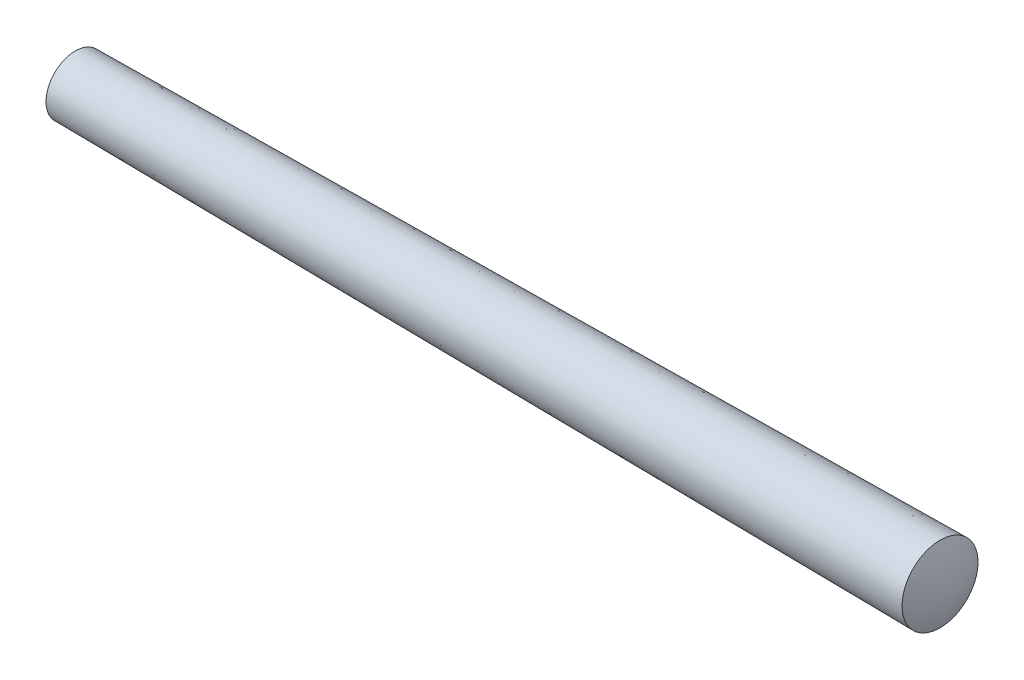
ISO-10303-21;
HEADER;
FILE_DESCRIPTION(('STEP AP214'),'2;1');
FILE_NAME('part.step','',(''),(''),'','','');
FILE_SCHEMA(('AUTOMOTIVE_DESIGN { 1 0 10303 214 1 1 1 1 }'));
ENDSEC;
DATA;
#1=APPLICATION_CONTEXT('core data for automotive mechanical design processes');
#2=APPLICATION_PROTOCOL_DEFINITION('international standard','automotive_design',2000,#1);
#3=PRODUCT_CONTEXT('',#1,'mechanical');
#4=PRODUCT('Part','Part','',(#3));
#5=PRODUCT_RELATED_PRODUCT_CATEGORY('part','',(#4));
#6=PRODUCT_DEFINITION_FORMATION('','',#4);
#7=PRODUCT_DEFINITION_CONTEXT('part definition',#1,'design');
#8=PRODUCT_DEFINITION('design','',#6,#7);
#9=PRODUCT_DEFINITION_SHAPE('','',#8);
#10=(LENGTH_UNIT() NAMED_UNIT(*) SI_UNIT(.MILLI.,.METRE.));
#11=(NAMED_UNIT(*) PLANE_ANGLE_UNIT() SI_UNIT($,.RADIAN.));
#12=(NAMED_UNIT(*) SI_UNIT($,.STERADIAN.) SOLID_ANGLE_UNIT());
#13=UNCERTAINTY_MEASURE_WITH_UNIT(LENGTH_MEASURE(1.E-05),#10,'distance_accuracy_value','');
#14=(GEOMETRIC_REPRESENTATION_CONTEXT(3) GLOBAL_UNCERTAINTY_ASSIGNED_CONTEXT((#13)) GLOBAL_UNIT_ASSIGNED_CONTEXT((#10,
#11,#12)) REPRESENTATION_CONTEXT('',''));
#15=CARTESIAN_POINT('',(0.,0.,0.));
#16=DIRECTION('',(0.,0.,1.));
#17=DIRECTION('',(1.,0.,0.));
#18=AXIS2_PLACEMENT_3D('',#15,#16,#17);
#19=CARTESIAN_POINT('',(40.08579500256,0.,0.));
#20=DIRECTION('',(-1.,0.,0.));
#21=DIRECTION('',(0.,1.,0.));
#22=AXIS2_PLACEMENT_3D('',#19,#20,#21);
#23=SPHERICAL_SURFACE('',#22,4.91420499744);
#24=CARTESIAN_POINT('',(44.6,0.,0.));
#25=DIRECTION('',(-1.,0.,0.));
#26=DIRECTION('',(0.,0.,1.));
#27=AXIS2_PLACEMENT_3D('',#24,#25,#26);
#28=CIRCLE('',#27,1.9419999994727);
#29=CARTESIAN_POINT('',(44.6,0.,1.9419999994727));
#30=VERTEX_POINT('',#29);
#31=EDGE_CURVE('E41',#30,#30,#28,.T.);
#32=ORIENTED_EDGE('',*,*,#31,.F.);
#33=EDGE_LOOP('',(#32));
#34=FACE_BOUND('',#33,.T.);
#35=ADVANCED_FACE('F35',(#34),#23,.T.);
#36=CARTESIAN_POINT('',(3.0125,0.,0.));
#37=DIRECTION('',(-1.,0.,0.));
#38=DIRECTION('',(0.,1.,0.));
#39=AXIS2_PLACEMENT_3D('',#36,#37,#38);
#40=SPHERICAL_SURFACE('',#39,3.0125);
#41=CARTESIAN_POINT('',(0.4,0.,0.));
#42=DIRECTION('',(-1.,0.,0.));
#43=DIRECTION('',(0.,0.,1.));
#44=AXIS2_PLACEMENT_3D('',#41,#42,#43);
#45=CIRCLE('',#44,1.5);
#46=CARTESIAN_POINT('',(0.4,0.,1.5));
#47=VERTEX_POINT('',#46);
#48=EDGE_CURVE('E10',#47,#47,#45,.T.);
#49=ORIENTED_EDGE('',*,*,#48,.T.);
#50=EDGE_LOOP('',(#49));
#51=FACE_BOUND('',#50,.T.);
#52=ADVANCED_FACE('F50',(#51),#40,.T.);
#53=CARTESIAN_POINT('',(44.6,0.,0.));
#54=DIRECTION('',(1.,0.,0.));
#55=DIRECTION('',(0.,0.,-1.));
#56=AXIS2_PLACEMENT_3D('',#53,#54,#55);
#57=CONICAL_SURFACE('',#56,1.9419999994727,0.00999966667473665);
#58=ORIENTED_EDGE('',*,*,#48,.F.);
#59=EDGE_LOOP('',(#58));
#60=FACE_BOUND('',#59,.T.);
#61=ORIENTED_EDGE('',*,*,#31,.T.);
#62=EDGE_LOOP('',(#61));
#63=FACE_BOUND('',#62,.T.);
#64=ADVANCED_FACE('F47',(#60,#63),#57,.T.);
#65=CLOSED_SHELL('',(#35,#52,#64));
#66=MANIFOLD_SOLID_BREP('B2',#65);
#67=ADVANCED_BREP_SHAPE_REPRESENTATION('',(#18,#66),#14);
#68=SHAPE_DEFINITION_REPRESENTATION(#9,#67);
ENDSEC;
END-ISO-10303-21;
